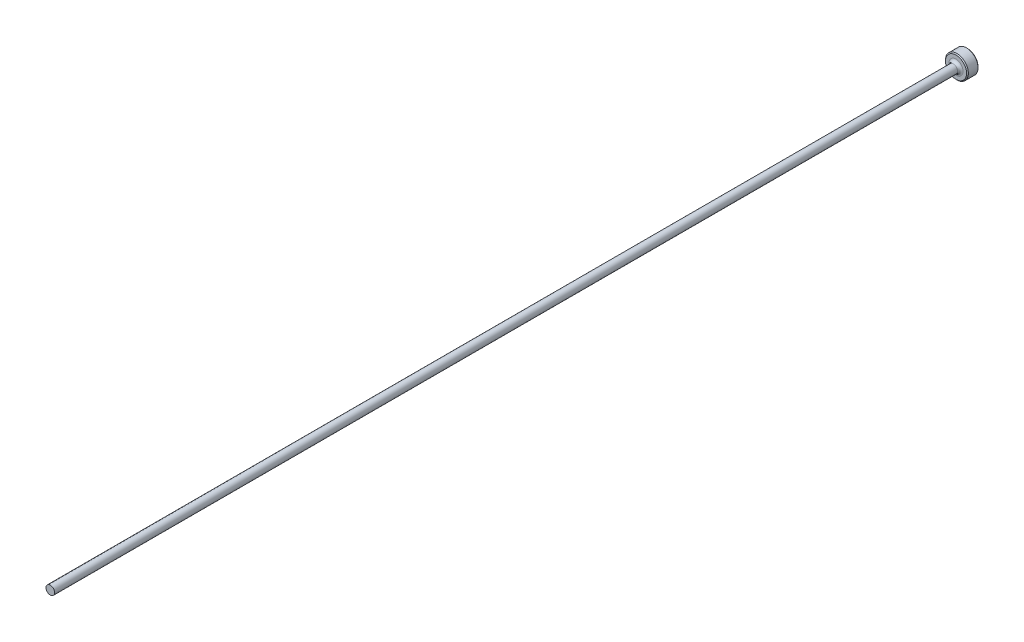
from build123d import *

# Parameters (mm, degrees)
CHAMFER1_SIZE = 0.254


with BuildPart() as part:
    # Sketch1 → Revolve1 (revolve)
    with BuildSketch(Plane(origin=(0, 0, 0), x_dir=(0, 0, -1), z_dir=(1, 0, 0)), mode=Mode.PRIVATE) as revolve1_sk:
        with BuildLine():
            Line((0, 0), (0, 3.175))
            Line((0, 3.175), (-3.175, 3.175))
            Line((-3.175, 3.175), (-3.175, 1.95199))
            ThreePointArc((-3.175, 1.95199), (-3.398184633, 1.413174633), (-3.937, 1.18999))
            Line((-3.937, 1.18999), (-254, 1.18999))
            Line((-254, 1.18999), (-254, 0))
            Line((-254, 0), (0, 0))
        make_face()
    revolve(revolve1_sk.sketch.rotate(Axis((0, 0, -25.434744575), (0, 0, 1)), 90), axis=Axis((0, 0, -25.434744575), (0, 0, 1)))

    # Chamfer1
    chamfer1_edges = [part.edges().sort_by_distance(p)[0] for p in [
        (3.175, 0, 0),
        (3.175, 0, 3.175),
    ]]
    chamfer(chamfer1_edges, length=CHAMFER1_SIZE)


solid = part.part
